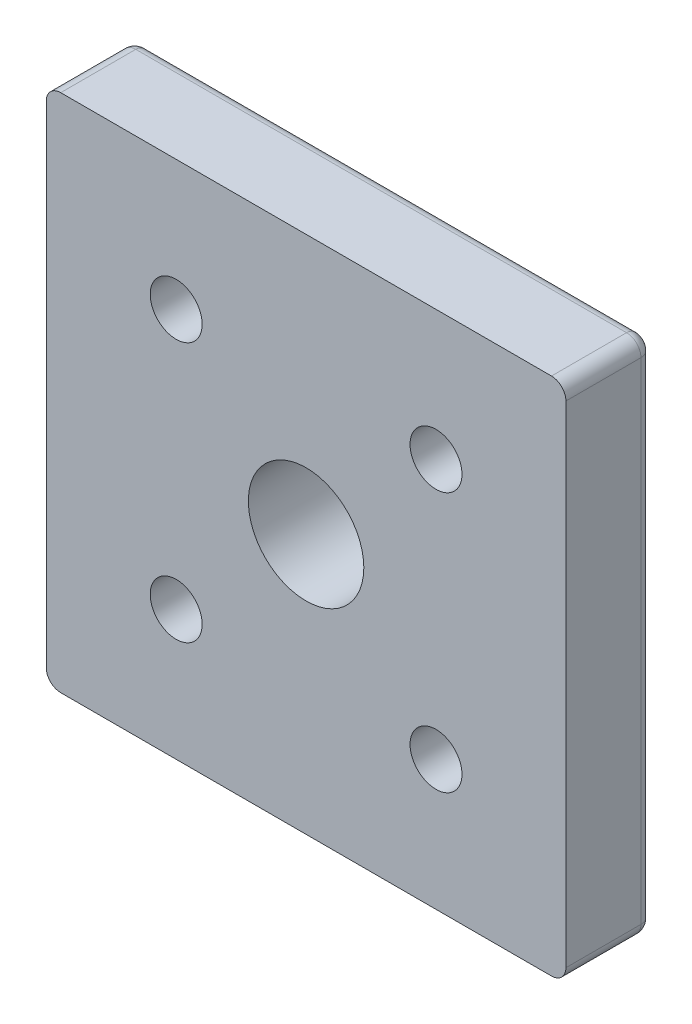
ISO-10303-21;
HEADER;
FILE_DESCRIPTION(('STEP AP214'),'2;1');
FILE_NAME('part.step','',(''),(''),'','','');
FILE_SCHEMA(('AUTOMOTIVE_DESIGN { 1 0 10303 214 1 1 1 1 }'));
ENDSEC;
DATA;
#1=APPLICATION_CONTEXT('core data for automotive mechanical design processes');
#2=APPLICATION_PROTOCOL_DEFINITION('international standard','automotive_design',2000,#1);
#3=PRODUCT_CONTEXT('',#1,'mechanical');
#4=PRODUCT('Part','Part','',(#3));
#5=PRODUCT_RELATED_PRODUCT_CATEGORY('part','',(#4));
#6=PRODUCT_DEFINITION_FORMATION('','',#4);
#7=PRODUCT_DEFINITION_CONTEXT('part definition',#1,'design');
#8=PRODUCT_DEFINITION('design','',#6,#7);
#9=PRODUCT_DEFINITION_SHAPE('','',#8);
#10=(LENGTH_UNIT() NAMED_UNIT(*) SI_UNIT(.MILLI.,.METRE.));
#11=(NAMED_UNIT(*) PLANE_ANGLE_UNIT() SI_UNIT($,.RADIAN.));
#12=(NAMED_UNIT(*) SI_UNIT($,.STERADIAN.) SOLID_ANGLE_UNIT());
#13=UNCERTAINTY_MEASURE_WITH_UNIT(LENGTH_MEASURE(1.E-05),#10,'distance_accuracy_value','');
#14=(GEOMETRIC_REPRESENTATION_CONTEXT(3) GLOBAL_UNCERTAINTY_ASSIGNED_CONTEXT((#13)) GLOBAL_UNIT_ASSIGNED_CONTEXT((#10,
#11,#12)) REPRESENTATION_CONTEXT('',''));
#15=CARTESIAN_POINT('',(0.,0.,0.));
#16=DIRECTION('',(0.,0.,1.));
#17=DIRECTION('',(1.,0.,0.));
#18=AXIS2_PLACEMENT_3D('',#15,#16,#17);
#19=CARTESIAN_POINT('',(22.5,-22.5,0.));
#20=DIRECTION('',(0.,0.,1.));
#21=DIRECTION('',(1.,0.,0.));
#22=AXIS2_PLACEMENT_3D('',#19,#20,#21);
#23=CYLINDRICAL_SURFACE('',#22,7.5);
#24=CARTESIAN_POINT('',(22.5,-22.5,5.5));
#25=DIRECTION('',(0.,0.,1.));
#26=DIRECTION('',(1.,0.,0.));
#27=AXIS2_PLACEMENT_3D('',#24,#25,#26);
#28=CIRCLE('',#27,7.5);
#29=CARTESIAN_POINT('',(30.,-22.5,5.5));
#30=VERTEX_POINT('',#29);
#31=EDGE_CURVE('E210',#30,#30,#28,.T.);
#32=ORIENTED_EDGE('',*,*,#31,.T.);
#33=EDGE_LOOP('',(#32));
#34=FACE_BOUND('',#33,.T.);
#35=CARTESIAN_POINT('',(22.5,-22.5,0.));
#36=DIRECTION('',(0.,0.,1.));
#37=DIRECTION('',(1.,0.,0.));
#38=AXIS2_PLACEMENT_3D('',#35,#36,#37);
#39=CIRCLE('',#38,7.5);
#40=CARTESIAN_POINT('',(30.,-22.5,0.));
#41=VERTEX_POINT('',#40);
#42=EDGE_CURVE('E222',#41,#41,#39,.F.);
#43=ORIENTED_EDGE('',*,*,#42,.T.);
#44=EDGE_LOOP('',(#43));
#45=FACE_BOUND('',#44,.T.);
#46=ADVANCED_FACE('F15',(#34,#45),#23,.F.);
#47=CARTESIAN_POINT('',(-22.5,-22.5,0.));
#48=DIRECTION('',(0.,0.,1.));
#49=DIRECTION('',(1.,0.,0.));
#50=AXIS2_PLACEMENT_3D('',#47,#48,#49);
#51=CYLINDRICAL_SURFACE('',#50,7.5);
#52=CARTESIAN_POINT('',(-22.5,-22.5,5.5));
#53=DIRECTION('',(0.,0.,1.));
#54=DIRECTION('',(1.,0.,0.));
#55=AXIS2_PLACEMENT_3D('',#52,#53,#54);
#56=CIRCLE('',#55,7.5);
#57=CARTESIAN_POINT('',(-15.,-22.5,5.5));
#58=VERTEX_POINT('',#57);
#59=EDGE_CURVE('E207',#58,#58,#56,.T.);
#60=ORIENTED_EDGE('',*,*,#59,.T.);
#61=EDGE_LOOP('',(#60));
#62=FACE_BOUND('',#61,.T.);
#63=CARTESIAN_POINT('',(-22.5,-22.5,0.));
#64=DIRECTION('',(0.,0.,1.));
#65=DIRECTION('',(1.,0.,0.));
#66=AXIS2_PLACEMENT_3D('',#63,#64,#65);
#67=CIRCLE('',#66,7.5);
#68=CARTESIAN_POINT('',(-15.,-22.5,0.));
#69=VERTEX_POINT('',#68);
#70=EDGE_CURVE('E216',#69,#69,#67,.F.);
#71=ORIENTED_EDGE('',*,*,#70,.T.);
#72=EDGE_LOOP('',(#71));
#73=FACE_BOUND('',#72,.T.);
#74=ADVANCED_FACE('F379',(#62,#73),#51,.F.);
#75=CARTESIAN_POINT('',(22.5,22.5,0.));
#76=DIRECTION('',(0.,0.,1.));
#77=DIRECTION('',(1.,0.,0.));
#78=AXIS2_PLACEMENT_3D('',#75,#76,#77);
#79=CYLINDRICAL_SURFACE('',#78,7.5);
#80=CARTESIAN_POINT('',(22.5,22.5,5.5));
#81=DIRECTION('',(0.,0.,1.));
#82=DIRECTION('',(1.,0.,0.));
#83=AXIS2_PLACEMENT_3D('',#80,#81,#82);
#84=CIRCLE('',#83,7.5);
#85=CARTESIAN_POINT('',(30.,22.5,5.5));
#86=VERTEX_POINT('',#85);
#87=EDGE_CURVE('E204',#86,#86,#84,.T.);
#88=ORIENTED_EDGE('',*,*,#87,.T.);
#89=EDGE_LOOP('',(#88));
#90=FACE_BOUND('',#89,.T.);
#91=CARTESIAN_POINT('',(22.5,22.5,0.));
#92=DIRECTION('',(0.,0.,1.));
#93=DIRECTION('',(1.,0.,0.));
#94=AXIS2_PLACEMENT_3D('',#91,#92,#93);
#95=CIRCLE('',#94,7.5);
#96=CARTESIAN_POINT('',(30.,22.5,0.));
#97=VERTEX_POINT('',#96);
#98=EDGE_CURVE('E219',#97,#97,#95,.F.);
#99=ORIENTED_EDGE('',*,*,#98,.T.);
#100=EDGE_LOOP('',(#99));
#101=FACE_BOUND('',#100,.T.);
#102=ADVANCED_FACE('F316',(#90,#101),#79,.F.);
#103=CARTESIAN_POINT('',(-22.5,22.5,0.));
#104=DIRECTION('',(0.,0.,1.));
#105=DIRECTION('',(1.,0.,0.));
#106=AXIS2_PLACEMENT_3D('',#103,#104,#105);
#107=CYLINDRICAL_SURFACE('',#106,7.5);
#108=CARTESIAN_POINT('',(-22.5,22.5,5.5));
#109=DIRECTION('',(0.,0.,1.));
#110=DIRECTION('',(1.,0.,0.));
#111=AXIS2_PLACEMENT_3D('',#108,#109,#110);
#112=CIRCLE('',#111,7.5);
#113=CARTESIAN_POINT('',(-15.,22.5,5.5));
#114=VERTEX_POINT('',#113);
#115=EDGE_CURVE('E128',#114,#114,#112,.T.);
#116=ORIENTED_EDGE('',*,*,#115,.T.);
#117=EDGE_LOOP('',(#116));
#118=FACE_BOUND('',#117,.T.);
#119=CARTESIAN_POINT('',(-22.5,22.5,0.));
#120=DIRECTION('',(0.,0.,1.));
#121=DIRECTION('',(1.,0.,0.));
#122=AXIS2_PLACEMENT_3D('',#119,#120,#121);
#123=CIRCLE('',#122,7.5);
#124=CARTESIAN_POINT('',(-15.,22.5,0.));
#125=VERTEX_POINT('',#124);
#126=EDGE_CURVE('E213',#125,#125,#123,.F.);
#127=ORIENTED_EDGE('',*,*,#126,.T.);
#128=EDGE_LOOP('',(#127));
#129=FACE_BOUND('',#128,.T.);
#130=ADVANCED_FACE('F308',(#118,#129),#107,.F.);
#131=CARTESIAN_POINT('',(42.5,42.5,2.));
#132=DIRECTION('',(0.,0.,-1.));
#133=DIRECTION('',(0.,1.,0.));
#134=AXIS2_PLACEMENT_3D('',#131,#132,#133);
#135=DEGENERATE_TOROIDAL_SURFACE('',#134,0.499999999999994,2.,.T.);
#136=CARTESIAN_POINT('',(42.5,43.,2.));
#137=DIRECTION('',(-1.,0.,0.));
#138=DIRECTION('',(0.,0.,1.));
#139=AXIS2_PLACEMENT_3D('',#136,#137,#138);
#140=CIRCLE('',#139,2.);
#141=CARTESIAN_POINT('',(42.5,45.,2.));
#142=VERTEX_POINT('',#141);
#143=CARTESIAN_POINT('',(42.5,43.,0.));
#144=VERTEX_POINT('',#143);
#145=EDGE_CURVE('E157',#142,#144,#140,.T.);
#146=ORIENTED_EDGE('',*,*,#145,.F.);
#147=CARTESIAN_POINT('',(42.5,42.5,2.));
#148=DIRECTION('',(0.,0.,1.));
#149=DIRECTION('',(1.,0.,0.));
#150=AXIS2_PLACEMENT_3D('',#147,#148,#149);
#151=CIRCLE('',#150,2.5);
#152=CARTESIAN_POINT('',(45.,42.5,2.));
#153=VERTEX_POINT('',#152);
#154=EDGE_CURVE('E124',#153,#142,#151,.T.);
#155=ORIENTED_EDGE('',*,*,#154,.F.);
#156=CARTESIAN_POINT('',(43.,42.5,2.));
#157=DIRECTION('',(0.,1.,0.));
#158=DIRECTION('',(0.,0.,1.));
#159=AXIS2_PLACEMENT_3D('',#156,#157,#158);
#160=CIRCLE('',#159,2.);
#161=CARTESIAN_POINT('',(43.,42.5,0.));
#162=VERTEX_POINT('',#161);
#163=EDGE_CURVE('E131',#162,#153,#160,.F.);
#164=ORIENTED_EDGE('',*,*,#163,.F.);
#165=CARTESIAN_POINT('',(42.5,42.5,0.));
#166=DIRECTION('',(0.,0.,-1.));
#167=DIRECTION('',(0.,1.,0.));
#168=AXIS2_PLACEMENT_3D('',#165,#166,#167);
#169=CIRCLE('',#168,0.500000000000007);
#170=EDGE_CURVE('E229',#162,#144,#169,.F.);
#171=ORIENTED_EDGE('',*,*,#170,.T.);
#172=EDGE_LOOP('',(#146,#155,#164,#171));
#173=FACE_BOUND('',#172,.T.);
#174=ADVANCED_FACE('F306',(#173),#135,.T.);
#175=CARTESIAN_POINT('',(-22.5,43.,2.));
#176=DIRECTION('',(-1.,0.,0.));
#177=DIRECTION('',(0.,0.,1.));
#178=AXIS2_PLACEMENT_3D('',#175,#176,#177);
#179=CYLINDRICAL_SURFACE('',#178,2.);
#180=CARTESIAN_POINT('',(-42.5,43.,1.99999999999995));
#181=DIRECTION('',(-1.,0.,0.));
#182=DIRECTION('',(0.,0.,1.));
#183=AXIS2_PLACEMENT_3D('',#180,#181,#182);
#184=CIRCLE('',#183,1.99999999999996);
#185=CARTESIAN_POINT('',(-42.5,45.,2.));
#186=VERTEX_POINT('',#185);
#187=CARTESIAN_POINT('',(-42.5,43.,0.));
#188=VERTEX_POINT('',#187);
#189=EDGE_CURVE('E152',#186,#188,#184,.T.);
#190=ORIENTED_EDGE('',*,*,#189,.F.);
#191=DIRECTION('',(1.,0.,0.));
#192=VECTOR('',#191,1.);
#193=CARTESIAN_POINT('',(-45.,45.,2.));
#194=LINE('',#193,#192);
#195=EDGE_CURVE('E127',#142,#186,#194,.F.);
#196=ORIENTED_EDGE('',*,*,#195,.F.);
#197=ORIENTED_EDGE('',*,*,#145,.T.);
#198=DIRECTION('',(1.,0.,0.));
#199=VECTOR('',#198,1.);
#200=CARTESIAN_POINT('',(0.,43.,0.));
#201=LINE('',#200,#199);
#202=EDGE_CURVE('E228',#144,#188,#201,.F.);
#203=ORIENTED_EDGE('',*,*,#202,.T.);
#204=EDGE_LOOP('',(#190,#196,#197,#203));
#205=FACE_BOUND('',#204,.T.);
#206=ADVANCED_FACE('F242',(#205),#179,.T.);
#207=CARTESIAN_POINT('',(-42.5,42.5,2.));
#208=DIRECTION('',(0.,0.,-1.));
#209=DIRECTION('',(-1.,0.,0.));
#210=AXIS2_PLACEMENT_3D('',#207,#208,#209);
#211=DEGENERATE_TOROIDAL_SURFACE('',#210,0.5,2.,.T.);
#212=CARTESIAN_POINT('',(-43.,42.5,2.));
#213=DIRECTION('',(0.,-1.,0.));
#214=DIRECTION('',(0.,0.,-1.));
#215=AXIS2_PLACEMENT_3D('',#212,#213,#214);
#216=CIRCLE('',#215,2.);
#217=CARTESIAN_POINT('',(-45.,42.5,2.));
#218=VERTEX_POINT('',#217);
#219=CARTESIAN_POINT('',(-43.,42.5,0.));
#220=VERTEX_POINT('',#219);
#221=EDGE_CURVE('E145',#218,#220,#216,.T.);
#222=ORIENTED_EDGE('',*,*,#221,.F.);
#223=CARTESIAN_POINT('',(-42.5,42.5,2.));
#224=DIRECTION('',(0.,0.,1.));
#225=DIRECTION('',(1.,0.,0.));
#226=AXIS2_PLACEMENT_3D('',#223,#224,#225);
#227=CIRCLE('',#226,2.5);
#228=EDGE_CURVE('E146',#186,#218,#227,.T.);
#229=ORIENTED_EDGE('',*,*,#228,.F.);
#230=ORIENTED_EDGE('',*,*,#189,.T.);
#231=CARTESIAN_POINT('',(-42.5,42.5,0.));
#232=DIRECTION('',(0.,0.,-1.));
#233=DIRECTION('',(-1.,0.,0.));
#234=AXIS2_PLACEMENT_3D('',#231,#232,#233);
#235=CIRCLE('',#234,0.500000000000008);
#236=EDGE_CURVE('E226',#188,#220,#235,.F.);
#237=ORIENTED_EDGE('',*,*,#236,.T.);
#238=EDGE_LOOP('',(#222,#229,#230,#237));
#239=FACE_BOUND('',#238,.T.);
#240=ADVANCED_FACE('F248',(#239),#211,.T.);
#241=CARTESIAN_POINT('',(-43.,-22.5,2.));
#242=DIRECTION('',(0.,-1.,0.));
#243=DIRECTION('',(0.,0.,-1.));
#244=AXIS2_PLACEMENT_3D('',#241,#242,#243);
#245=CYLINDRICAL_SURFACE('',#244,2.);
#246=CARTESIAN_POINT('',(-43.,-42.5,2.));
#247=DIRECTION('',(0.,-1.,0.));
#248=DIRECTION('',(0.,0.,-1.));
#249=AXIS2_PLACEMENT_3D('',#246,#247,#248);
#250=CIRCLE('',#249,2.);
#251=CARTESIAN_POINT('',(-45.,-42.5,2.));
#252=VERTEX_POINT('',#251);
#253=CARTESIAN_POINT('',(-43.,-42.5,0.));
#254=VERTEX_POINT('',#253);
#255=EDGE_CURVE('E83',#252,#254,#250,.T.);
#256=ORIENTED_EDGE('',*,*,#255,.F.);
#257=DIRECTION('',(0.,1.,0.));
#258=VECTOR('',#257,1.);
#259=CARTESIAN_POINT('',(-45.,-45.,2.));
#260=LINE('',#259,#258);
#261=EDGE_CURVE('E140',#218,#252,#260,.F.);
#262=ORIENTED_EDGE('',*,*,#261,.F.);
#263=ORIENTED_EDGE('',*,*,#221,.T.);
#264=DIRECTION('',(0.,1.,0.));
#265=VECTOR('',#264,1.);
#266=CARTESIAN_POINT('',(-43.,0.,0.));
#267=LINE('',#266,#265);
#268=EDGE_CURVE('E225',#220,#254,#267,.F.);
#269=ORIENTED_EDGE('',*,*,#268,.T.);
#270=EDGE_LOOP('',(#256,#262,#263,#269));
#271=FACE_BOUND('',#270,.T.);
#272=ADVANCED_FACE('F268',(#271),#245,.T.);
#273=CARTESIAN_POINT('',(-42.5,-42.5,2.));
#274=DIRECTION('',(0.,0.,-1.));
#275=DIRECTION('',(-1.,0.,0.));
#276=AXIS2_PLACEMENT_3D('',#273,#274,#275);
#277=DEGENERATE_TOROIDAL_SURFACE('',#276,0.5,2.,.T.);
#278=ORIENTED_EDGE('',*,*,#255,.T.);
#279=CARTESIAN_POINT('',(-42.5,-42.5,0.));
#280=DIRECTION('',(0.,0.,-1.));
#281=DIRECTION('',(-1.,0.,0.));
#282=AXIS2_PLACEMENT_3D('',#279,#280,#281);
#283=CIRCLE('',#282,0.500000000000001);
#284=CARTESIAN_POINT('',(-42.5,-43.,0.));
#285=VERTEX_POINT('',#284);
#286=EDGE_CURVE('E19',#254,#285,#283,.F.);
#287=ORIENTED_EDGE('',*,*,#286,.T.);
#288=CARTESIAN_POINT('',(-42.5,-43.,2.));
#289=DIRECTION('',(1.,0.,0.));
#290=DIRECTION('',(0.,0.,-1.));
#291=AXIS2_PLACEMENT_3D('',#288,#289,#290);
#292=CIRCLE('',#291,2.);
#293=CARTESIAN_POINT('',(-42.5,-45.,2.));
#294=VERTEX_POINT('',#293);
#295=EDGE_CURVE('E90',#294,#285,#292,.T.);
#296=ORIENTED_EDGE('',*,*,#295,.F.);
#297=CARTESIAN_POINT('',(-42.5,-42.5,2.));
#298=DIRECTION('',(0.,0.,1.));
#299=DIRECTION('',(1.,0.,0.));
#300=AXIS2_PLACEMENT_3D('',#297,#298,#299);
#301=CIRCLE('',#300,2.5);
#302=EDGE_CURVE('E137',#252,#294,#301,.T.);
#303=ORIENTED_EDGE('',*,*,#302,.F.);
#304=EDGE_LOOP('',(#278,#287,#296,#303));
#305=FACE_BOUND('',#304,.T.);
#306=ADVANCED_FACE('F88',(#305),#277,.T.);
#307=CARTESIAN_POINT('',(22.5,-43.,2.));
#308=DIRECTION('',(1.,0.,0.));
#309=DIRECTION('',(0.,0.,-1.));
#310=AXIS2_PLACEMENT_3D('',#307,#308,#309);
#311=CYLINDRICAL_SURFACE('',#310,2.);
#312=ORIENTED_EDGE('',*,*,#295,.T.);
#313=DIRECTION('',(1.,0.,0.));
#314=VECTOR('',#313,1.);
#315=CARTESIAN_POINT('',(0.,-43.,0.));
#316=LINE('',#315,#314);
#317=CARTESIAN_POINT('',(42.5,-43.,0.));
#318=VERTEX_POINT('',#317);
#319=EDGE_CURVE('E95',#285,#318,#316,.T.);
#320=ORIENTED_EDGE('',*,*,#319,.T.);
#321=CARTESIAN_POINT('',(42.5000000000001,-43.,2.));
#322=DIRECTION('',(1.,0.,0.));
#323=DIRECTION('',(0.,0.,-1.));
#324=AXIS2_PLACEMENT_3D('',#321,#322,#323);
#325=CIRCLE('',#324,2.);
#326=CARTESIAN_POINT('',(42.5,-45.,2.));
#327=VERTEX_POINT('',#326);
#328=EDGE_CURVE('E104',#327,#318,#325,.T.);
#329=ORIENTED_EDGE('',*,*,#328,.F.);
#330=DIRECTION('',(1.,0.,0.));
#331=VECTOR('',#330,1.);
#332=CARTESIAN_POINT('',(45.,-45.,2.));
#333=LINE('',#332,#331);
#334=EDGE_CURVE('E102',#294,#327,#333,.T.);
#335=ORIENTED_EDGE('',*,*,#334,.F.);
#336=EDGE_LOOP('',(#312,#320,#329,#335));
#337=FACE_BOUND('',#336,.T.);
#338=ADVANCED_FACE('F98',(#337),#311,.T.);
#339=CARTESIAN_POINT('',(42.5,-42.5,2.));
#340=DIRECTION('',(0.,0.,-1.));
#341=DIRECTION('',(-1.,0.,0.));
#342=AXIS2_PLACEMENT_3D('',#339,#340,#341);
#343=DEGENERATE_TOROIDAL_SURFACE('',#342,0.499999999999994,2.,.T.);
#344=ORIENTED_EDGE('',*,*,#328,.T.);
#345=CARTESIAN_POINT('',(42.5,-42.5,0.));
#346=DIRECTION('',(0.,0.,-1.));
#347=DIRECTION('',(-1.,0.,0.));
#348=AXIS2_PLACEMENT_3D('',#345,#346,#347);
#349=CIRCLE('',#348,0.5);
#350=CARTESIAN_POINT('',(43.,-42.5,0.));
#351=VERTEX_POINT('',#350);
#352=EDGE_CURVE('E110',#318,#351,#349,.F.);
#353=ORIENTED_EDGE('',*,*,#352,.T.);
#354=CARTESIAN_POINT('',(43.,-42.5,2.));
#355=DIRECTION('',(0.,1.,0.));
#356=DIRECTION('',(0.,0.,1.));
#357=AXIS2_PLACEMENT_3D('',#354,#355,#356);
#358=CIRCLE('',#357,2.);
#359=CARTESIAN_POINT('',(45.,-42.5,2.));
#360=VERTEX_POINT('',#359);
#361=EDGE_CURVE('E96',#360,#351,#358,.T.);
#362=ORIENTED_EDGE('',*,*,#361,.F.);
#363=CARTESIAN_POINT('',(42.5,-42.5,2.));
#364=DIRECTION('',(0.,0.,1.));
#365=DIRECTION('',(1.,0.,0.));
#366=AXIS2_PLACEMENT_3D('',#363,#364,#365);
#367=CIRCLE('',#366,2.5);
#368=EDGE_CURVE('E116',#327,#360,#367,.T.);
#369=ORIENTED_EDGE('',*,*,#368,.F.);
#370=EDGE_LOOP('',(#344,#353,#362,#369));
#371=FACE_BOUND('',#370,.T.);
#372=ADVANCED_FACE('F372',(#371),#343,.T.);
#373=CARTESIAN_POINT('',(43.,22.5,2.));
#374=DIRECTION('',(0.,1.,0.));
#375=DIRECTION('',(0.,0.,1.));
#376=AXIS2_PLACEMENT_3D('',#373,#374,#375);
#377=CYLINDRICAL_SURFACE('',#376,2.);
#378=ORIENTED_EDGE('',*,*,#361,.T.);
#379=DIRECTION('',(0.,1.,0.));
#380=VECTOR('',#379,1.);
#381=CARTESIAN_POINT('',(43.,0.,0.));
#382=LINE('',#381,#380);
#383=EDGE_CURVE('E112',#351,#162,#382,.T.);
#384=ORIENTED_EDGE('',*,*,#383,.T.);
#385=ORIENTED_EDGE('',*,*,#163,.T.);
#386=DIRECTION('',(0.,1.,0.));
#387=VECTOR('',#386,1.);
#388=CARTESIAN_POINT('',(45.,45.,2.));
#389=LINE('',#388,#387);
#390=EDGE_CURVE('E120',#360,#153,#389,.T.);
#391=ORIENTED_EDGE('',*,*,#390,.F.);
#392=EDGE_LOOP('',(#378,#384,#385,#391));
#393=FACE_BOUND('',#392,.T.);
#394=ADVANCED_FACE('F235',(#393),#377,.T.);
#395=CARTESIAN_POINT('',(0.,0.,0.));
#396=DIRECTION('',(0.,0.,1.));
#397=DIRECTION('',(1.,0.,0.));
#398=AXIS2_PLACEMENT_3D('',#395,#396,#397);
#399=PLANE('',#398);
#400=ORIENTED_EDGE('',*,*,#126,.F.);
#401=EDGE_LOOP('',(#400));
#402=FACE_BOUND('',#401,.T.);
#403=ORIENTED_EDGE('',*,*,#70,.F.);
#404=EDGE_LOOP('',(#403));
#405=FACE_BOUND('',#404,.T.);
#406=ORIENTED_EDGE('',*,*,#98,.F.);
#407=EDGE_LOOP('',(#406));
#408=FACE_BOUND('',#407,.T.);
#409=ORIENTED_EDGE('',*,*,#42,.F.);
#410=EDGE_LOOP('',(#409));
#411=FACE_BOUND('',#410,.T.);
#412=CARTESIAN_POINT('',(0.,0.,0.));
#413=DIRECTION('',(0.,0.,1.));
#414=DIRECTION('',(1.,0.,0.));
#415=AXIS2_PLACEMENT_3D('',#412,#413,#414);
#416=CIRCLE('',#415,10.);
#417=CARTESIAN_POINT('',(10.,0.,0.));
#418=VERTEX_POINT('',#417);
#419=EDGE_CURVE('E199',#418,#418,#416,.T.);
#420=ORIENTED_EDGE('',*,*,#419,.T.);
#421=EDGE_LOOP('',(#420));
#422=FACE_BOUND('',#421,.T.);
#423=ORIENTED_EDGE('',*,*,#236,.F.);
#424=ORIENTED_EDGE('',*,*,#202,.F.);
#425=ORIENTED_EDGE('',*,*,#170,.F.);
#426=ORIENTED_EDGE('',*,*,#383,.F.);
#427=ORIENTED_EDGE('',*,*,#352,.F.);
#428=ORIENTED_EDGE('',*,*,#319,.F.);
#429=ORIENTED_EDGE('',*,*,#286,.F.);
#430=ORIENTED_EDGE('',*,*,#268,.F.);
#431=EDGE_LOOP('',(#423,#424,#425,#426,#427,#428,#429,#430));
#432=FACE_BOUND('',#431,.T.);
#433=ADVANCED_FACE('F108',(#402,#405,#408,#411,#422,#432),#399,.F.);
#434=CARTESIAN_POINT('',(30.15,-14.85,5.5));
#435=DIRECTION('',(0.,0.,1.));
#436=DIRECTION('',(-1.,0.,0.));
#437=AXIS2_PLACEMENT_3D('',#434,#435,#436);
#438=PLANE('',#437);
#439=CARTESIAN_POINT('',(22.5,-22.5,5.5));
#440=DIRECTION('',(0.,0.,1.));
#441=DIRECTION('',(1.,0.,0.));
#442=AXIS2_PLACEMENT_3D('',#439,#440,#441);
#443=CIRCLE('',#442,4.5);
#444=CARTESIAN_POINT('',(27.,-22.5,5.5));
#445=VERTEX_POINT('',#444);
#446=EDGE_CURVE('E196',#445,#445,#443,.T.);
#447=ORIENTED_EDGE('',*,*,#446,.T.);
#448=EDGE_LOOP('',(#447));
#449=FACE_BOUND('',#448,.T.);
#450=ORIENTED_EDGE('',*,*,#31,.F.);
#451=EDGE_LOOP('',(#450));
#452=FACE_BOUND('',#451,.T.);
#453=ADVANCED_FACE('F368',(#449,#452),#438,.F.);
#454=CARTESIAN_POINT('',(-14.85,-14.85,5.5));
#455=DIRECTION('',(0.,0.,1.));
#456=DIRECTION('',(-1.,0.,0.));
#457=AXIS2_PLACEMENT_3D('',#454,#455,#456);
#458=PLANE('',#457);
#459=CARTESIAN_POINT('',(-22.5,-22.5,5.5));
#460=DIRECTION('',(0.,0.,1.));
#461=DIRECTION('',(1.,0.,0.));
#462=AXIS2_PLACEMENT_3D('',#459,#460,#461);
#463=CIRCLE('',#462,4.5);
#464=CARTESIAN_POINT('',(-18.,-22.5,5.5));
#465=VERTEX_POINT('',#464);
#466=EDGE_CURVE('E193',#465,#465,#463,.T.);
#467=ORIENTED_EDGE('',*,*,#466,.T.);
#468=EDGE_LOOP('',(#467));
#469=FACE_BOUND('',#468,.T.);
#470=ORIENTED_EDGE('',*,*,#59,.F.);
#471=EDGE_LOOP('',(#470));
#472=FACE_BOUND('',#471,.T.);
#473=ADVANCED_FACE('F403',(#469,#472),#458,.F.);
#474=CARTESIAN_POINT('',(30.15,30.15,5.5));
#475=DIRECTION('',(0.,0.,1.));
#476=DIRECTION('',(-1.,0.,0.));
#477=AXIS2_PLACEMENT_3D('',#474,#475,#476);
#478=PLANE('',#477);
#479=CARTESIAN_POINT('',(22.5,22.5,5.5));
#480=DIRECTION('',(0.,0.,1.));
#481=DIRECTION('',(1.,0.,0.));
#482=AXIS2_PLACEMENT_3D('',#479,#480,#481);
#483=CIRCLE('',#482,4.5);
#484=CARTESIAN_POINT('',(27.,22.5,5.5));
#485=VERTEX_POINT('',#484);
#486=EDGE_CURVE('E190',#485,#485,#483,.T.);
#487=ORIENTED_EDGE('',*,*,#486,.T.);
#488=EDGE_LOOP('',(#487));
#489=FACE_BOUND('',#488,.T.);
#490=ORIENTED_EDGE('',*,*,#87,.F.);
#491=EDGE_LOOP('',(#490));
#492=FACE_BOUND('',#491,.T.);
#493=ADVANCED_FACE('F401',(#489,#492),#478,.F.);
#494=CARTESIAN_POINT('',(-14.85,30.15,5.5));
#495=DIRECTION('',(0.,0.,1.));
#496=DIRECTION('',(-1.,0.,0.));
#497=AXIS2_PLACEMENT_3D('',#494,#495,#496);
#498=PLANE('',#497);
#499=CARTESIAN_POINT('',(-22.5,22.5,5.5));
#500=DIRECTION('',(0.,0.,1.));
#501=DIRECTION('',(1.,0.,0.));
#502=AXIS2_PLACEMENT_3D('',#499,#500,#501);
#503=CIRCLE('',#502,4.5);
#504=CARTESIAN_POINT('',(-18.,22.5,5.5));
#505=VERTEX_POINT('',#504);
#506=EDGE_CURVE('E187',#505,#505,#503,.T.);
#507=ORIENTED_EDGE('',*,*,#506,.T.);
#508=EDGE_LOOP('',(#507));
#509=FACE_BOUND('',#508,.T.);
#510=ORIENTED_EDGE('',*,*,#115,.F.);
#511=EDGE_LOOP('',(#510));
#512=FACE_BOUND('',#511,.T.);
#513=ADVANCED_FACE('F17',(#509,#512),#498,.F.);
#514=CARTESIAN_POINT('',(42.5,42.5,0.));
#515=DIRECTION('',(0.,0.,1.));
#516=DIRECTION('',(1.,0.,0.));
#517=AXIS2_PLACEMENT_3D('',#514,#515,#516);
#518=CYLINDRICAL_SURFACE('',#517,2.5);
#519=CARTESIAN_POINT('',(42.5,42.5,15.));
#520=DIRECTION('',(0.,0.,1.));
#521=DIRECTION('',(1.,0.,0.));
#522=AXIS2_PLACEMENT_3D('',#519,#520,#521);
#523=CIRCLE('',#522,2.5);
#524=CARTESIAN_POINT('',(45.,42.5,15.));
#525=VERTEX_POINT('',#524);
#526=CARTESIAN_POINT('',(42.5,45.,15.));
#527=VERTEX_POINT('',#526);
#528=EDGE_CURVE('E184',#525,#527,#523,.T.);
#529=ORIENTED_EDGE('',*,*,#528,.F.);
#530=DIRECTION('',(0.,0.,-1.));
#531=VECTOR('',#530,1.);
#532=CARTESIAN_POINT('',(45.,42.5,0.));
#533=LINE('',#532,#531);
#534=EDGE_CURVE('E123',#153,#525,#533,.F.);
#535=ORIENTED_EDGE('',*,*,#534,.F.);
#536=ORIENTED_EDGE('',*,*,#154,.T.);
#537=DIRECTION('',(0.,0.,1.));
#538=VECTOR('',#537,1.);
#539=CARTESIAN_POINT('',(42.5,45.,0.));
#540=LINE('',#539,#538);
#541=EDGE_CURVE('E149',#527,#142,#540,.F.);
#542=ORIENTED_EDGE('',*,*,#541,.F.);
#543=EDGE_LOOP('',(#529,#535,#536,#542));
#544=FACE_BOUND('',#543,.T.);
#545=ADVANCED_FACE('F299',(#544),#518,.T.);
#546=CARTESIAN_POINT('',(-45.,45.,0.));
#547=DIRECTION('',(0.,1.,0.));
#548=DIRECTION('',(0.,0.,1.));
#549=AXIS2_PLACEMENT_3D('',#546,#547,#548);
#550=PLANE('',#549);
#551=DIRECTION('',(1.,0.,0.));
#552=VECTOR('',#551,1.);
#553=CARTESIAN_POINT('',(0.,45.,15.));
#554=LINE('',#553,#552);
#555=CARTESIAN_POINT('',(-42.5,45.,15.));
#556=VERTEX_POINT('',#555);
#557=EDGE_CURVE('E183',#527,#556,#554,.F.);
#558=ORIENTED_EDGE('',*,*,#557,.F.);
#559=ORIENTED_EDGE('',*,*,#541,.T.);
#560=ORIENTED_EDGE('',*,*,#195,.T.);
#561=DIRECTION('',(0.,0.,1.));
#562=VECTOR('',#561,1.);
#563=CARTESIAN_POINT('',(-42.5,45.,0.));
#564=LINE('',#563,#562);
#565=EDGE_CURVE('E143',#556,#186,#564,.F.);
#566=ORIENTED_EDGE('',*,*,#565,.F.);
#567=EDGE_LOOP('',(#558,#559,#560,#566));
#568=FACE_BOUND('',#567,.T.);
#569=ADVANCED_FACE('F258',(#568),#550,.T.);
#570=CARTESIAN_POINT('',(-42.5,42.5,0.));
#571=DIRECTION('',(0.,0.,1.));
#572=DIRECTION('',(1.,0.,0.));
#573=AXIS2_PLACEMENT_3D('',#570,#571,#572);
#574=CYLINDRICAL_SURFACE('',#573,2.5);
#575=CARTESIAN_POINT('',(-42.5,42.5,15.));
#576=DIRECTION('',(0.,0.,1.));
#577=DIRECTION('',(1.,0.,0.));
#578=AXIS2_PLACEMENT_3D('',#575,#576,#577);
#579=CIRCLE('',#578,2.5);
#580=CARTESIAN_POINT('',(-45.,42.5,15.));
#581=VERTEX_POINT('',#580);
#582=EDGE_CURVE('E180',#556,#581,#579,.T.);
#583=ORIENTED_EDGE('',*,*,#582,.F.);
#584=ORIENTED_EDGE('',*,*,#565,.T.);
#585=ORIENTED_EDGE('',*,*,#228,.T.);
#586=DIRECTION('',(0.,0.,1.));
#587=VECTOR('',#586,1.);
#588=CARTESIAN_POINT('',(-45.,42.5,0.));
#589=LINE('',#588,#587);
#590=EDGE_CURVE('E138',#581,#218,#589,.F.);
#591=ORIENTED_EDGE('',*,*,#590,.F.);
#592=EDGE_LOOP('',(#583,#584,#585,#591));
#593=FACE_BOUND('',#592,.T.);
#594=ADVANCED_FACE('F260',(#593),#574,.T.);
#595=CARTESIAN_POINT('',(-45.,-45.,0.));
#596=DIRECTION('',(-1.,0.,0.));
#597=DIRECTION('',(0.,0.,1.));
#598=AXIS2_PLACEMENT_3D('',#595,#596,#597);
#599=PLANE('',#598);
#600=DIRECTION('',(0.,1.,0.));
#601=VECTOR('',#600,1.);
#602=CARTESIAN_POINT('',(-45.,0.,15.));
#603=LINE('',#602,#601);
#604=CARTESIAN_POINT('',(-45.,-42.5,15.));
#605=VERTEX_POINT('',#604);
#606=EDGE_CURVE('E179',#581,#605,#603,.F.);
#607=ORIENTED_EDGE('',*,*,#606,.F.);
#608=ORIENTED_EDGE('',*,*,#590,.T.);
#609=ORIENTED_EDGE('',*,*,#261,.T.);
#610=DIRECTION('',(0.,0.,1.));
#611=VECTOR('',#610,1.);
#612=CARTESIAN_POINT('',(-45.,-42.5,0.));
#613=LINE('',#612,#611);
#614=EDGE_CURVE('E135',#605,#252,#613,.F.);
#615=ORIENTED_EDGE('',*,*,#614,.F.);
#616=EDGE_LOOP('',(#607,#608,#609,#615));
#617=FACE_BOUND('',#616,.T.);
#618=ADVANCED_FACE('F274',(#617),#599,.T.);
#619=CARTESIAN_POINT('',(-42.5,-42.5,0.));
#620=DIRECTION('',(0.,0.,1.));
#621=DIRECTION('',(1.,0.,0.));
#622=AXIS2_PLACEMENT_3D('',#619,#620,#621);
#623=CYLINDRICAL_SURFACE('',#622,2.5);
#624=CARTESIAN_POINT('',(-42.5,-42.5,15.));
#625=DIRECTION('',(0.,0.,1.));
#626=DIRECTION('',(1.,0.,0.));
#627=AXIS2_PLACEMENT_3D('',#624,#625,#626);
#628=CIRCLE('',#627,2.5);
#629=CARTESIAN_POINT('',(-42.5,-45.,15.));
#630=VERTEX_POINT('',#629);
#631=EDGE_CURVE('E176',#605,#630,#628,.T.);
#632=ORIENTED_EDGE('',*,*,#631,.F.);
#633=ORIENTED_EDGE('',*,*,#614,.T.);
#634=ORIENTED_EDGE('',*,*,#302,.T.);
#635=DIRECTION('',(0.,0.,-1.));
#636=VECTOR('',#635,1.);
#637=CARTESIAN_POINT('',(-42.5,-45.,0.));
#638=LINE('',#637,#636);
#639=EDGE_CURVE('E119',#630,#294,#638,.T.);
#640=ORIENTED_EDGE('',*,*,#639,.F.);
#641=EDGE_LOOP('',(#632,#633,#634,#640));
#642=FACE_BOUND('',#641,.T.);
#643=ADVANCED_FACE('F278',(#642),#623,.T.);
#644=CARTESIAN_POINT('',(45.,-45.,0.));
#645=DIRECTION('',(0.,-1.,0.));
#646=DIRECTION('',(0.,0.,-1.));
#647=AXIS2_PLACEMENT_3D('',#644,#645,#646);
#648=PLANE('',#647);
#649=DIRECTION('',(1.,0.,0.));
#650=VECTOR('',#649,1.);
#651=CARTESIAN_POINT('',(0.,-45.,15.));
#652=LINE('',#651,#650);
#653=CARTESIAN_POINT('',(42.5,-45.,15.));
#654=VERTEX_POINT('',#653);
#655=EDGE_CURVE('E175',#630,#654,#652,.T.);
#656=ORIENTED_EDGE('',*,*,#655,.F.);
#657=ORIENTED_EDGE('',*,*,#639,.T.);
#658=ORIENTED_EDGE('',*,*,#334,.T.);
#659=DIRECTION('',(0.,0.,1.));
#660=VECTOR('',#659,1.);
#661=CARTESIAN_POINT('',(42.5,-45.,0.));
#662=LINE('',#661,#660);
#663=EDGE_CURVE('E118',#654,#327,#662,.F.);
#664=ORIENTED_EDGE('',*,*,#663,.F.);
#665=EDGE_LOOP('',(#656,#657,#658,#664));
#666=FACE_BOUND('',#665,.T.);
#667=ADVANCED_FACE('F352',(#666),#648,.T.);
#668=CARTESIAN_POINT('',(42.5,-42.5,0.));
#669=DIRECTION('',(0.,0.,1.));
#670=DIRECTION('',(1.,0.,0.));
#671=AXIS2_PLACEMENT_3D('',#668,#669,#670);
#672=CYLINDRICAL_SURFACE('',#671,2.5);
#673=CARTESIAN_POINT('',(42.5,-42.5,15.));
#674=DIRECTION('',(0.,0.,1.));
#675=DIRECTION('',(1.,0.,0.));
#676=AXIS2_PLACEMENT_3D('',#673,#674,#675);
#677=CIRCLE('',#676,2.5);
#678=CARTESIAN_POINT('',(45.,-42.5,15.));
#679=VERTEX_POINT('',#678);
#680=EDGE_CURVE('E172',#654,#679,#677,.T.);
#681=ORIENTED_EDGE('',*,*,#680,.F.);
#682=ORIENTED_EDGE('',*,*,#663,.T.);
#683=ORIENTED_EDGE('',*,*,#368,.T.);
#684=DIRECTION('',(0.,0.,-1.));
#685=VECTOR('',#684,1.);
#686=CARTESIAN_POINT('',(45.,-42.5,0.));
#687=LINE('',#686,#685);
#688=EDGE_CURVE('E34',#679,#360,#687,.T.);
#689=ORIENTED_EDGE('',*,*,#688,.F.);
#690=EDGE_LOOP('',(#681,#682,#683,#689));
#691=FACE_BOUND('',#690,.T.);
#692=ADVANCED_FACE('F349',(#691),#672,.T.);
#693=CARTESIAN_POINT('',(45.,45.,0.));
#694=DIRECTION('',(1.,0.,0.));
#695=DIRECTION('',(0.,0.,-1.));
#696=AXIS2_PLACEMENT_3D('',#693,#694,#695);
#697=PLANE('',#696);
#698=DIRECTION('',(0.,1.,0.));
#699=VECTOR('',#698,1.);
#700=CARTESIAN_POINT('',(45.,0.,15.));
#701=LINE('',#700,#699);
#702=EDGE_CURVE('E171',#679,#525,#701,.T.);
#703=ORIENTED_EDGE('',*,*,#702,.F.);
#704=ORIENTED_EDGE('',*,*,#688,.T.);
#705=ORIENTED_EDGE('',*,*,#390,.T.);
#706=ORIENTED_EDGE('',*,*,#534,.T.);
#707=EDGE_LOOP('',(#703,#704,#705,#706));
#708=FACE_BOUND('',#707,.T.);
#709=ADVANCED_FACE('F296',(#708),#697,.T.);
#710=CARTESIAN_POINT('',(0.,0.,0.));
#711=DIRECTION('',(0.,0.,1.));
#712=DIRECTION('',(1.,0.,0.));
#713=AXIS2_PLACEMENT_3D('',#710,#711,#712);
#714=CYLINDRICAL_SURFACE('',#713,10.);
#715=ORIENTED_EDGE('',*,*,#419,.F.);
#716=EDGE_LOOP('',(#715));
#717=FACE_BOUND('',#716,.T.);
#718=CARTESIAN_POINT('',(0.,0.,15.));
#719=DIRECTION('',(0.,0.,1.));
#720=DIRECTION('',(1.,0.,0.));
#721=AXIS2_PLACEMENT_3D('',#718,#719,#720);
#722=CIRCLE('',#721,10.);
#723=CARTESIAN_POINT('',(10.,0.,15.));
#724=VERTEX_POINT('',#723);
#725=EDGE_CURVE('E168',#724,#724,#722,.F.);
#726=ORIENTED_EDGE('',*,*,#725,.F.);
#727=EDGE_LOOP('',(#726));
#728=FACE_BOUND('',#727,.T.);
#729=ADVANCED_FACE('F342',(#717,#728),#714,.F.);
#730=CARTESIAN_POINT('',(22.5,-22.5,0.));
#731=DIRECTION('',(0.,0.,1.));
#732=DIRECTION('',(1.,0.,0.));
#733=AXIS2_PLACEMENT_3D('',#730,#731,#732);
#734=CYLINDRICAL_SURFACE('',#733,4.5);
#735=CARTESIAN_POINT('',(22.5,-22.5,15.));
#736=DIRECTION('',(0.,0.,1.));
#737=DIRECTION('',(1.,0.,0.));
#738=AXIS2_PLACEMENT_3D('',#735,#736,#737);
#739=CIRCLE('',#738,4.5);
#740=CARTESIAN_POINT('',(27.,-22.5,15.));
#741=VERTEX_POINT('',#740);
#742=EDGE_CURVE('E165',#741,#741,#739,.F.);
#743=ORIENTED_EDGE('',*,*,#742,.F.);
#744=EDGE_LOOP('',(#743));
#745=FACE_BOUND('',#744,.T.);
#746=ORIENTED_EDGE('',*,*,#446,.F.);
#747=EDGE_LOOP('',(#746));
#748=FACE_BOUND('',#747,.T.);
#749=ADVANCED_FACE('F338',(#745,#748),#734,.F.);
#750=CARTESIAN_POINT('',(-22.5,-22.5,0.));
#751=DIRECTION('',(0.,0.,1.));
#752=DIRECTION('',(1.,0.,0.));
#753=AXIS2_PLACEMENT_3D('',#750,#751,#752);
#754=CYLINDRICAL_SURFACE('',#753,4.5);
#755=CARTESIAN_POINT('',(-22.5,-22.5,15.));
#756=DIRECTION('',(0.,0.,1.));
#757=DIRECTION('',(1.,0.,0.));
#758=AXIS2_PLACEMENT_3D('',#755,#756,#757);
#759=CIRCLE('',#758,4.5);
#760=CARTESIAN_POINT('',(-18.,-22.5,15.));
#761=VERTEX_POINT('',#760);
#762=EDGE_CURVE('E162',#761,#761,#759,.F.);
#763=ORIENTED_EDGE('',*,*,#762,.F.);
#764=EDGE_LOOP('',(#763));
#765=FACE_BOUND('',#764,.T.);
#766=ORIENTED_EDGE('',*,*,#466,.F.);
#767=EDGE_LOOP('',(#766));
#768=FACE_BOUND('',#767,.T.);
#769=ADVANCED_FACE('F334',(#765,#768),#754,.F.);
#770=CARTESIAN_POINT('',(22.5,22.5,0.));
#771=DIRECTION('',(0.,0.,1.));
#772=DIRECTION('',(1.,0.,0.));
#773=AXIS2_PLACEMENT_3D('',#770,#771,#772);
#774=CYLINDRICAL_SURFACE('',#773,4.5);
#775=CARTESIAN_POINT('',(22.5,22.5,15.));
#776=DIRECTION('',(0.,0.,1.));
#777=DIRECTION('',(1.,0.,0.));
#778=AXIS2_PLACEMENT_3D('',#775,#776,#777);
#779=CIRCLE('',#778,4.5);
#780=CARTESIAN_POINT('',(27.,22.5,15.));
#781=VERTEX_POINT('',#780);
#782=EDGE_CURVE('E25',#781,#781,#779,.F.);
#783=ORIENTED_EDGE('',*,*,#782,.F.);
#784=EDGE_LOOP('',(#783));
#785=FACE_BOUND('',#784,.T.);
#786=ORIENTED_EDGE('',*,*,#486,.F.);
#787=EDGE_LOOP('',(#786));
#788=FACE_BOUND('',#787,.T.);
#789=ADVANCED_FACE('F327',(#785,#788),#774,.F.);
#790=CARTESIAN_POINT('',(-22.5,22.5,0.));
#791=DIRECTION('',(0.,0.,1.));
#792=DIRECTION('',(1.,0.,0.));
#793=AXIS2_PLACEMENT_3D('',#790,#791,#792);
#794=CYLINDRICAL_SURFACE('',#793,4.5);
#795=CARTESIAN_POINT('',(-22.5,22.5,15.));
#796=DIRECTION('',(0.,0.,1.));
#797=DIRECTION('',(1.,0.,0.));
#798=AXIS2_PLACEMENT_3D('',#795,#796,#797);
#799=CIRCLE('',#798,4.5);
#800=CARTESIAN_POINT('',(-18.,22.5,15.));
#801=VERTEX_POINT('',#800);
#802=EDGE_CURVE('E10',#801,#801,#799,.F.);
#803=ORIENTED_EDGE('',*,*,#802,.F.);
#804=EDGE_LOOP('',(#803));
#805=FACE_BOUND('',#804,.T.);
#806=ORIENTED_EDGE('',*,*,#506,.F.);
#807=EDGE_LOOP('',(#806));
#808=FACE_BOUND('',#807,.T.);
#809=ADVANCED_FACE('F321',(#805,#808),#794,.F.);
#810=CARTESIAN_POINT('',(0.,0.,15.));
#811=DIRECTION('',(0.,0.,1.));
#812=DIRECTION('',(1.,0.,0.));
#813=AXIS2_PLACEMENT_3D('',#810,#811,#812);
#814=PLANE('',#813);
#815=ORIENTED_EDGE('',*,*,#802,.T.);
#816=EDGE_LOOP('',(#815));
#817=FACE_BOUND('',#816,.T.);
#818=ORIENTED_EDGE('',*,*,#782,.T.);
#819=EDGE_LOOP('',(#818));
#820=FACE_BOUND('',#819,.T.);
#821=ORIENTED_EDGE('',*,*,#762,.T.);
#822=EDGE_LOOP('',(#821));
#823=FACE_BOUND('',#822,.T.);
#824=ORIENTED_EDGE('',*,*,#742,.T.);
#825=EDGE_LOOP('',(#824));
#826=FACE_BOUND('',#825,.T.);
#827=ORIENTED_EDGE('',*,*,#725,.T.);
#828=EDGE_LOOP('',(#827));
#829=FACE_BOUND('',#828,.T.);
#830=ORIENTED_EDGE('',*,*,#680,.T.);
#831=ORIENTED_EDGE('',*,*,#702,.T.);
#832=ORIENTED_EDGE('',*,*,#528,.T.);
#833=ORIENTED_EDGE('',*,*,#557,.T.);
#834=ORIENTED_EDGE('',*,*,#582,.T.);
#835=ORIENTED_EDGE('',*,*,#606,.T.);
#836=ORIENTED_EDGE('',*,*,#631,.T.);
#837=ORIENTED_EDGE('',*,*,#655,.T.);
#838=EDGE_LOOP('',(#830,#831,#832,#833,#834,#835,#836,#837));
#839=FACE_BOUND('',#838,.T.);
#840=ADVANCED_FACE('F294',(#817,#820,#823,#826,#829,#839),#814,.T.);
#841=CLOSED_SHELL('',(#46,#74,#102,#130,#174,#206,#240,#272,#306,#338,#372,#394,#433,#453,#473,
#493,#513,#545,#569,#594,#618,#643,#667,#692,#709,#729,#749,#769,#789,#809,#840));
#842=MANIFOLD_SOLID_BREP('B1',#841);
#843=ADVANCED_BREP_SHAPE_REPRESENTATION('',(#18,#842),#14);
#844=SHAPE_DEFINITION_REPRESENTATION(#9,#843);
ENDSEC;
END-ISO-10303-21;
